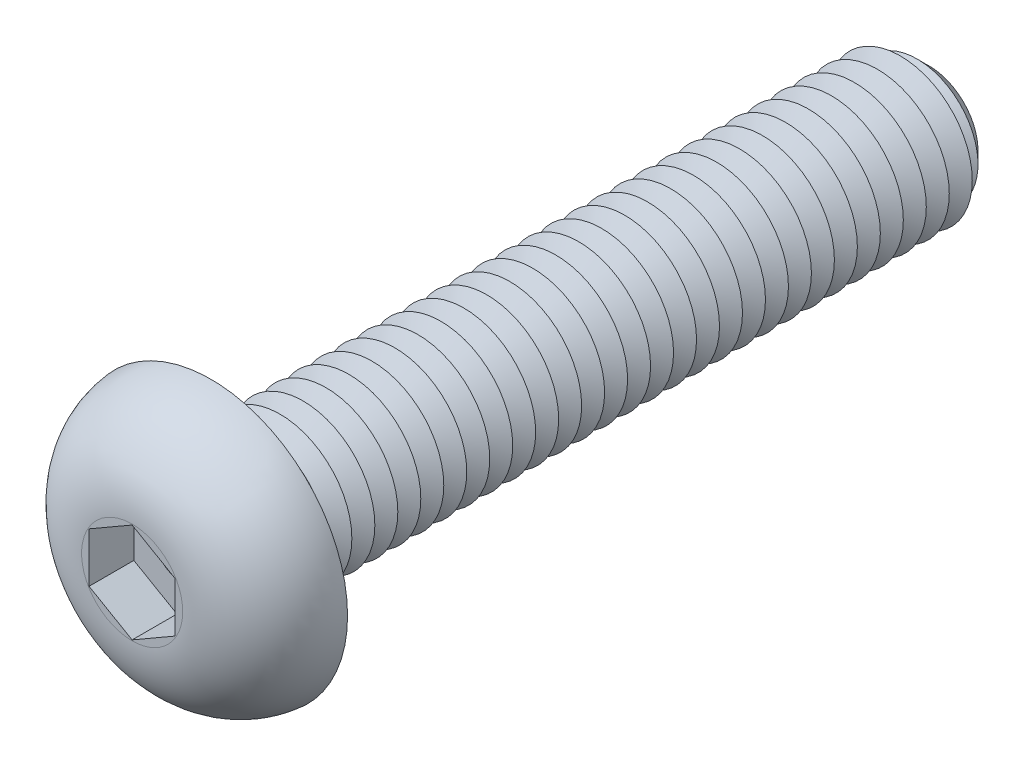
from build123d import *

# Parameters (mm, degrees)
CUT_EXTRUDE1_DEPTH  = 1.56
SKETCH4_R           = 2.5
BOSS_EXTRUDE1_DEPTH = 25
CHAMFER1_SIZE       = 0.8
LPATTERN1_COUNT     = 30
LPATTERN1_PITCH     = 0.8
FILLET2_R           = 0.4
SKETCH6_R           = 0.65
CUT_EXTRUDE2_DEPTH  = 26.19


with BuildPart() as part:
    # Sketch2 → Revolve1 (revolve)
    with BuildSketch(Plane(origin=(0, 0, 0), x_dir=(0, 0, -1), z_dir=(1, 0, 0)), mode=Mode.PRIVATE) as revolve1_sk:
        with BuildLine():
            Line((0, 0), (-2.75, 0))
            Line((-2.75, 0), (-2.75, 1.760434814))
            ThreePointArc((-2.75, 1.760434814), (-1.957940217, 3.791444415), (0, 4.75))
            Line((0, 4.75), (0, 0))
        make_face()
    revolve(revolve1_sk.sketch.rotate(Axis((0, 0, 47.934239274), (0, 0, -1)), 90), axis=Axis((0, 0, 47.934239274), (0, 0, -1)))

    # Sketch3 → Cut-Extrude1 (cut)
    with BuildSketch(Plane.XY.offset(2.75)):
        Polygon((0, 1.732050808), (-1.5, 0.866025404), (-1.5, -0.866025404), (0, -1.732050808), (1.5, -0.866025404), (1.5, 0.866025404), align=None)
    extrude(amount=-CUT_EXTRUDE1_DEPTH, mode=Mode.SUBTRACT)

    # Sketch4 → Boss-Extrude1 (add)
    with BuildSketch(Plane(origin=(0, 0, 0), x_dir=(-1, 0, 0), z_dir=(0, 0, -1))):
        with Locations(Location((0, 0, 0), (0, 0, 180))):
            Circle(SKETCH4_R)
    extrude(amount=BOSS_EXTRUDE1_DEPTH)

    # Chamfer1
    chamfer1_edges = [part.edges().sort_by_distance(p)[0] for p in [
        (-2.5, 0, -25),
    ]]
    chamfer(chamfer1_edges, length=CHAMFER1_SIZE)

    # Sketch5 → Cut-Revolve1 (revolve, cut)
    with BuildSketch(Plane(origin=(0, 0, 0), x_dir=(0, 0, -1), z_dir=(1, 0, 0)), mode=Mode.PRIVATE) as cut_revolve1_sk:
        Polygon((0.8, 2.5), (1.6, 2.5), (1.2, 1.807179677), align=None)
    cut_revolve1 = revolve(cut_revolve1_sk.sketch.rotate(Axis((0, 0, 47.934239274), (0, 0, -1)), 90), axis=Axis((0, 0, 47.934239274), (0, 0, -1)), mode=Mode.SUBTRACT)

    # LPattern1: Cut-Revolve1 ×30
    with Locations(*[(0, 0, -i * LPATTERN1_PITCH) for i in range(1, LPATTERN1_COUNT)]):
        add(cut_revolve1, mode=Mode.SUBTRACT)

    # Fillet2
    fillet2_edges = [part.edges().sort_by_distance(p)[0] for p in [
        (-2.5, 0, 0),
    ]]
    fillet(fillet2_edges, radius=FILLET2_R)

    # Sketch6 → Cut-Extrude2 (cut)
    with BuildSketch(Plane.XY.offset(1.19)):
        Circle(SKETCH6_R)
    extrude(amount=-CUT_EXTRUDE2_DEPTH, mode=Mode.SUBTRACT)


solid = part.part
